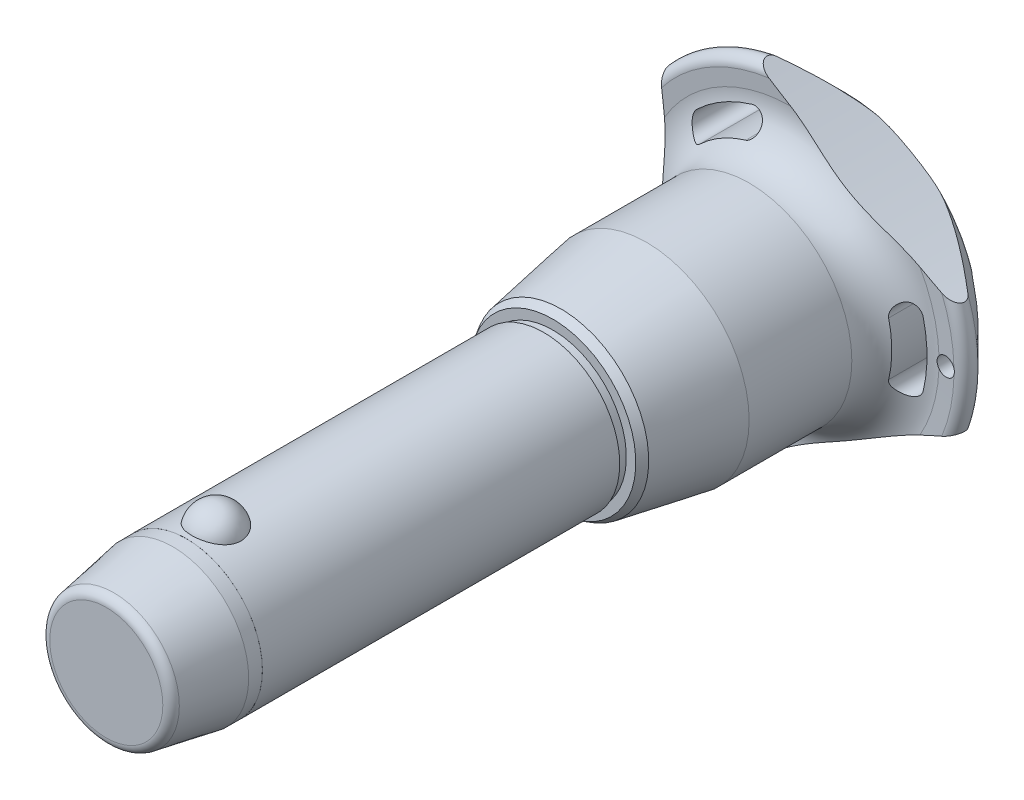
from build123d import *

# Parameters (mm, degrees)
SKETCH1_R           = 12.5
BOSS_EXTRUDE1_DEPTH = 50
SKETCH2_R           = 10
BOSS_EXTRUDE2_DEPTH = 50.7
BOSS_EXTRUDE3_START = 22
SKETCH1_2_R         = 12.5
BOSS_EXTRUDE3_DEPTH = 22
CHAMFER1_SIZE       = 11
CHAMFER1_SIZE2      = 1.939596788
FILLET1_R           = 1.5
SKETCH6_R           = 176.92625
CUT_EXTRUDE1_DEPTH  = 109.493284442
CIRPATTERN1_COUNT   = 3
SKETCH7_R           = 1.5
CUT_EXTRUDE2_DEPTH  = 109.35288326
SKETCH8_R           = 12.5
SKETCH8_R_2         = 12.49
CUT_EXTRUDE3_DEPTH  = 13.2


with BuildPart() as part:
    # Sketch1 → Boss-Extrude1 (new body)
    with BuildSketch(Plane.XY):
        Circle(SKETCH1_R)
    extrude(amount=-BOSS_EXTRUDE1_DEPTH)

    # Sketch2 → Boss-Extrude2 (add)
    with BuildSketch(Plane(origin=(0, 0, -50), x_dir=(-1, 0, 0), z_dir=(0, 0, -1))):
        with Locations(Location((0, 0, 0), (0, 0, 180))):
            Circle(SKETCH2_R)
    extrude(amount=BOSS_EXTRUDE2_DEPTH)

    # Sketch3 → Revolve1 (revolve)
    with BuildSketch(Plane(origin=(0, 0, 0), x_dir=(0, 0, -1), z_dir=(1, 0, 0))):
        with BuildLine():
            Line((-3.957271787, 15.4), (-3.957271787, 7.1))
            ThreePointArc((-3.957271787, 7.1), (0.192728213, 11.25), (-3.957271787, 15.4))
        make_face()
        with BuildLine():
            Line((-3.957271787, -7.1), (-3.957271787, -15.4))
            ThreePointArc((-3.957271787, -15.4), (0.192728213, -11.25), (-3.957271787, -7.1))
        make_face()
    revolve(axis=Axis((0, -7.1, 3.957271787), (0, 1, 0)))

    # Sketch1_2 → Boss-Extrude3 (add)
    with BuildSketch(Plane.XY.offset(BOSS_EXTRUDE3_START)):
        Circle(SKETCH1_2_R)
    extrude(amount=-BOSS_EXTRUDE3_DEPTH)

    # Chamfer1
    chamfer1_edges = [part.edges().sort_by_distance(p)[0] for p in [
        (-12.5, 0, 22),
    ]]
    chamfer1_side = [part.faces().sort_by_distance(p)[0] for p in [
        (-12.5, 0, -14),
    ]]
    chamfer(chamfer1_edges, length=CHAMFER1_SIZE, length2=CHAMFER1_SIZE2, reference=chamfer1_side[0])

    # Fillet1
    fillet1_edges = [part.edges().sort_by_distance(p)[0] for p in [
        (-10.560403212, 0, 22),
        (-10, 0, -100.7),
    ]]
    fillet(fillet1_edges, radius=FILLET1_R)

    # Sketch4 → Revolve2 (revolve)
    with BuildSketch(Plane(origin=(0, 0, 0), x_dir=(0, 0, -1), z_dir=(1, 0, 0)), mode=Mode.PRIVATE) as revolve2_sk:
        Polygon((50, 0), (50, 12.089202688), (51.5, 12.089202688), (51.5, 13.644437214), (52.846872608, 14.422054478), (66.9, 16.9), (83.8, 16.9), (83.8, 0), align=None)
    revolve(revolve2_sk.sketch.rotate(Axis((0, 0, -83.8), (0, 0, 1)), 90), axis=Axis((0, 0, -83.8), (0, 0, 1)))

    # Sketch5 → Revolve3 (revolve)
    with BuildSketch(Plane(origin=(0, 0, 0), x_dir=(0, 0, -1), z_dir=(1, 0, 0)), mode=Mode.PRIVATE) as revolve3_sk:
        with BuildLine():
            Line((90.790129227, 24.271609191), (90.652256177, 26.865060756))
            ThreePointArc((90.652256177, 26.865060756), (91.598671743, 28.411427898), (93.38137085, 28.08137085))
            Line((93.38137085, 28.08137085), (99.763226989, 21.69951471))
            ThreePointArc((99.763226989, 21.69951471), (100.7, 19.381044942), (99.683055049, 17.096604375))
            ThreePointArc((99.683055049, 17.096604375), (94.18864484, 9.321268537), (92.25, 0))
            Line((92.25, 0), (83.8, 0))
            Line((83.8, 0), (83.8, 16.9))
            ThreePointArc((83.8, 16.9), (88.879432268, 19.083427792), (90.790129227, 24.271609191))
        make_face()
    revolve(revolve3_sk.sketch.rotate(Axis((0, 0, -92.25), (0, 0, 1)), 90), axis=Axis((0, 0, -92.25), (0, 0, 1)))

    # Sketch6 → Cut-Extrude1 (cut, through all)
    with BuildSketch(Plane.XY):
        with Locations((-197.42625, 0)):
            Circle(SKETCH6_R)
        with BuildLine():
            ThreePointArc((21.802992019, -5.260839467), (22.428706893, 0), (21.802992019, 5.260839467))
            ThreePointArc((21.802992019, 5.260839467), (19.579234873, 6.620060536), (18.220013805, 4.39630339))
            ThreePointArc((18.220013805, 4.39630339), (18.742902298, 0), (18.220013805, -4.39630339))
            ThreePointArc((18.220013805, -4.39630339), (19.579234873, -6.620060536), (21.802992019, -5.260839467))
        make_face()
    cut_extrude1 = extrude(amount=-CUT_EXTRUDE1_DEPTH, mode=Mode.SUBTRACT)

    # CirPattern1: Cut-Extrude1 ×3 about axis
    cirpattern1_axis = Axis((0, 0, 0), (0, 0, 1))
    for i in range(1, CIRPATTERN1_COUNT):
        add(cut_extrude1.rotate(cirpattern1_axis, i * 360 / CIRPATTERN1_COUNT), mode=Mode.SUBTRACT)

    # Sketch7 → Cut-Extrude2 (cut, through all)
    with BuildSketch(Plane.XY):
        with Locations(Location((25.428706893, 0, 0), (0, 0, 17.230769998))):
            Circle(SKETCH7_R)
    extrude(amount=-CUT_EXTRUDE2_DEPTH, mode=Mode.SUBTRACT)

    # Sketch8 → Cut-Extrude3 (cut)
    with BuildSketch(Plane.XY.offset(22)):
        Circle(SKETCH8_R)
        Circle(SKETCH8_R_2, mode=Mode.SUBTRACT)
    extrude(amount=-CUT_EXTRUDE3_DEPTH, mode=Mode.SUBTRACT)


solid = part.part
